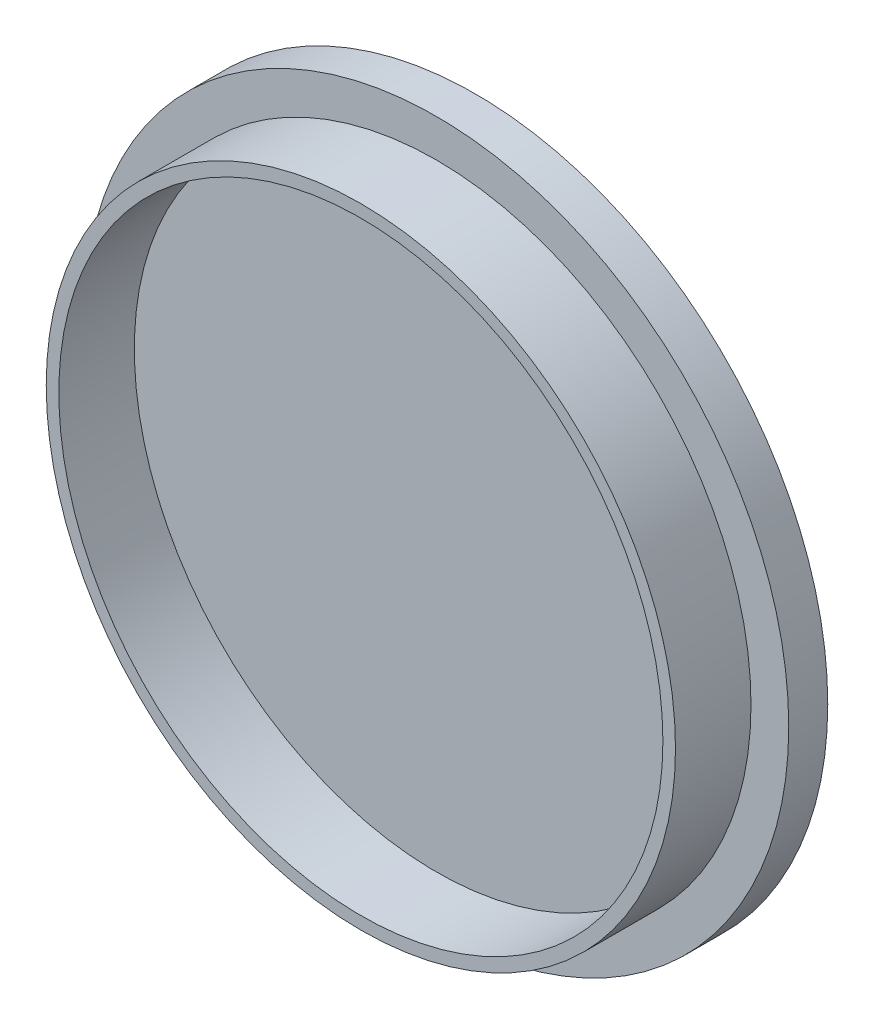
ISO-10303-21;
HEADER;
FILE_DESCRIPTION(('STEP AP214'),'2;1');
FILE_NAME('part.step','',(''),(''),'','','');
FILE_SCHEMA(('AUTOMOTIVE_DESIGN { 1 0 10303 214 1 1 1 1 }'));
ENDSEC;
DATA;
#1=APPLICATION_CONTEXT('core data for automotive mechanical design processes');
#2=APPLICATION_PROTOCOL_DEFINITION('international standard','automotive_design',2000,#1);
#3=PRODUCT_CONTEXT('',#1,'mechanical');
#4=PRODUCT('Part','Part','',(#3));
#5=PRODUCT_RELATED_PRODUCT_CATEGORY('part','',(#4));
#6=PRODUCT_DEFINITION_FORMATION('','',#4);
#7=PRODUCT_DEFINITION_CONTEXT('part definition',#1,'design');
#8=PRODUCT_DEFINITION('design','',#6,#7);
#9=PRODUCT_DEFINITION_SHAPE('','',#8);
#10=(LENGTH_UNIT() NAMED_UNIT(*) SI_UNIT(.MILLI.,.METRE.));
#11=(NAMED_UNIT(*) PLANE_ANGLE_UNIT() SI_UNIT($,.RADIAN.));
#12=(NAMED_UNIT(*) SI_UNIT($,.STERADIAN.) SOLID_ANGLE_UNIT());
#13=UNCERTAINTY_MEASURE_WITH_UNIT(LENGTH_MEASURE(1.E-05),#10,'distance_accuracy_value','');
#14=(GEOMETRIC_REPRESENTATION_CONTEXT(3) GLOBAL_UNCERTAINTY_ASSIGNED_CONTEXT((#13)) GLOBAL_UNIT_ASSIGNED_CONTEXT((#10,
#11,#12)) REPRESENTATION_CONTEXT('',''));
#15=CARTESIAN_POINT('',(0.,0.,0.));
#16=DIRECTION('',(0.,0.,1.));
#17=DIRECTION('',(1.,0.,0.));
#18=AXIS2_PLACEMENT_3D('',#15,#16,#17);
#19=CARTESIAN_POINT('',(0.,0.,3.09999999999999));
#20=DIRECTION('',(0.,0.,1.));
#21=DIRECTION('',(1.,0.,0.));
#22=AXIS2_PLACEMENT_3D('',#19,#20,#21);
#23=PLANE('',#22);
#24=CARTESIAN_POINT('',(0.,0.,3.09999999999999));
#25=DIRECTION('',(0.,0.,1.));
#26=DIRECTION('',(1.,0.,0.));
#27=AXIS2_PLACEMENT_3D('',#24,#25,#26);
#28=CIRCLE('',#27,28.);
#29=CARTESIAN_POINT('',(-28.,0.,3.09999999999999));
#30=VERTEX_POINT('',#29);
#31=EDGE_CURVE('E37',#30,#30,#28,.T.);
#32=ORIENTED_EDGE('',*,*,#31,.T.);
#33=EDGE_LOOP('',(#32));
#34=FACE_BOUND('',#33,.T.);
#35=CARTESIAN_POINT('',(0.,0.,3.09999999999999));
#36=DIRECTION('',(0.,0.,1.));
#37=DIRECTION('',(1.,0.,0.));
#38=AXIS2_PLACEMENT_3D('',#35,#36,#37);
#39=CIRCLE('',#38,25.);
#40=CARTESIAN_POINT('',(25.,0.,3.09999999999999));
#41=VERTEX_POINT('',#40);
#42=EDGE_CURVE('E50',#41,#41,#39,.T.);
#43=ORIENTED_EDGE('',*,*,#42,.F.);
#44=EDGE_LOOP('',(#43));
#45=FACE_BOUND('',#44,.T.);
#46=ADVANCED_FACE('F30',(#34,#45),#23,.T.);
#47=CARTESIAN_POINT('',(0.,0.,3.09999999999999));
#48=DIRECTION('',(0.,0.,-1.));
#49=DIRECTION('',(-1.,0.,0.));
#50=AXIS2_PLACEMENT_3D('',#47,#48,#49);
#51=CYLINDRICAL_SURFACE('',#50,28.);
#52=CARTESIAN_POINT('',(0.,0.,0.));
#53=DIRECTION('',(0.,0.,1.));
#54=DIRECTION('',(1.,0.,0.));
#55=AXIS2_PLACEMENT_3D('',#52,#53,#54);
#56=CIRCLE('',#55,28.);
#57=CARTESIAN_POINT('',(-28.,0.,0.));
#58=VERTEX_POINT('',#57);
#59=EDGE_CURVE('E41',#58,#58,#56,.T.);
#60=CARTESIAN_POINT('',(-28.,0.,3.09999999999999));
#61=CARTESIAN_POINT('',(-28.,0.,3.06770833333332));
#62=CARTESIAN_POINT('',(-28.,0.,3.03541666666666));
#63=CARTESIAN_POINT('',(-28.,0.,2.97083333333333));
#64=CARTESIAN_POINT('',(-28.,0.,2.93854166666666));
#65=CARTESIAN_POINT('',(-28.,0.,2.87395833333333));
#66=CARTESIAN_POINT('',(-28.,0.,2.84166666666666));
#67=CARTESIAN_POINT('',(-28.,0.,2.77708333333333));
#68=CARTESIAN_POINT('',(-28.,0.,2.74479166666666));
#69=CARTESIAN_POINT('',(-28.,0.,2.68020833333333));
#70=CARTESIAN_POINT('',(-28.,0.,2.64791666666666));
#71=CARTESIAN_POINT('',(-28.,0.,2.58333333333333));
#72=CARTESIAN_POINT('',(-28.,0.,2.55104166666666));
#73=CARTESIAN_POINT('',(-28.,0.,2.48645833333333));
#74=CARTESIAN_POINT('',(-28.,0.,2.45416666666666));
#75=CARTESIAN_POINT('',(-28.,0.,2.38958333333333));
#76=CARTESIAN_POINT('',(-28.,0.,2.35729166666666));
#77=CARTESIAN_POINT('',(-28.,0.,2.29270833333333));
#78=CARTESIAN_POINT('',(-28.,0.,2.26041666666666));
#79=CARTESIAN_POINT('',(-28.,0.,2.19583333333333));
#80=CARTESIAN_POINT('',(-28.,0.,2.16354166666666));
#81=CARTESIAN_POINT('',(-28.,0.,2.09895833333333));
#82=CARTESIAN_POINT('',(-28.,0.,2.06666666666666));
#83=CARTESIAN_POINT('',(-28.,0.,2.00208333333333));
#84=CARTESIAN_POINT('',(-28.,0.,1.96979166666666));
#85=CARTESIAN_POINT('',(-28.,0.,1.90520833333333));
#86=CARTESIAN_POINT('',(-28.,0.,1.87291666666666));
#87=CARTESIAN_POINT('',(-28.,0.,1.80833333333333));
#88=CARTESIAN_POINT('',(-28.,0.,1.77604166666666));
#89=CARTESIAN_POINT('',(-28.,0.,1.71145833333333));
#90=CARTESIAN_POINT('',(-28.,0.,1.67916666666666));
#91=CARTESIAN_POINT('',(-28.,0.,1.61458333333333));
#92=CARTESIAN_POINT('',(-28.,0.,1.58229166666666));
#93=CARTESIAN_POINT('',(-28.,0.,1.51770833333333));
#94=CARTESIAN_POINT('',(-28.,0.,1.48541666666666));
#95=CARTESIAN_POINT('',(-28.,0.,1.42083333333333));
#96=CARTESIAN_POINT('',(-28.,0.,1.38854166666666));
#97=CARTESIAN_POINT('',(-28.,0.,1.32395833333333));
#98=CARTESIAN_POINT('',(-28.,0.,1.29166666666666));
#99=CARTESIAN_POINT('',(-28.,0.,1.22708333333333));
#100=CARTESIAN_POINT('',(-28.,0.,1.19479166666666));
#101=CARTESIAN_POINT('',(-28.,0.,1.13020833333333));
#102=CARTESIAN_POINT('',(-28.,0.,1.09791666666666));
#103=CARTESIAN_POINT('',(-28.,0.,1.03333333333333));
#104=CARTESIAN_POINT('',(-28.,0.,1.00104166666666));
#105=CARTESIAN_POINT('',(-28.,0.,0.93645833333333));
#106=CARTESIAN_POINT('',(-28.,0.,0.904166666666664));
#107=CARTESIAN_POINT('',(-28.,0.,0.839583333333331));
#108=CARTESIAN_POINT('',(-28.,0.,0.807291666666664));
#109=CARTESIAN_POINT('',(-28.,0.,0.742708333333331));
#110=CARTESIAN_POINT('',(-28.,0.,0.710416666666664));
#111=CARTESIAN_POINT('',(-28.,0.,0.645833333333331));
#112=CARTESIAN_POINT('',(-28.,0.,0.613541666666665));
#113=CARTESIAN_POINT('',(-28.,0.,0.548958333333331));
#114=CARTESIAN_POINT('',(-28.,0.,0.516666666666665));
#115=CARTESIAN_POINT('',(-28.,0.,0.452083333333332));
#116=CARTESIAN_POINT('',(-28.,0.,0.419791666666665));
#117=CARTESIAN_POINT('',(-28.,0.,0.355208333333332));
#118=CARTESIAN_POINT('',(-28.,0.,0.322916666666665));
#119=CARTESIAN_POINT('',(-28.,0.,0.258333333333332));
#120=CARTESIAN_POINT('',(-28.,0.,0.226041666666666));
#121=CARTESIAN_POINT('',(-28.,0.,0.161458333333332));
#122=CARTESIAN_POINT('',(-28.,0.,0.129166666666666));
#123=CARTESIAN_POINT('',(-28.,0.,0.0645833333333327));
#124=CARTESIAN_POINT('',(-28.,0.,0.0322916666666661));
#125=CARTESIAN_POINT('',(-28.,0.,0.));
#126=B_SPLINE_CURVE_WITH_KNOTS('',3,(#60,#61,#62,#63,#64,#65,#66,#67,#68,#69,#70,#71,#72,#73,
#74,#75,#76,#77,#78,#79,#80,#81,#82,#83,#84,#85,#86,#87,#88,#89,#90,#91,#92,#93,#94,#95,#96,#97,
#98,#99,#100,#101,#102,#103,#104,#105,#106,#107,#108,#109,#110,#111,#112,#113,#114,#115,#116,
#117,#118,#119,#120,#121,#122,#123,#124,#125),.UNSPECIFIED.,.F.,.F.,(4,2,2,2,2,2,2,2,2,2,2,2,2,
2,2,2,2,2,2,2,2,2,2,2,2,2,2,2,2,2,2,2,4),(0.,0.0968749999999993,0.193749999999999,
0.290624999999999,0.387499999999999,0.484374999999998,0.581249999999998,0.678124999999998,
0.774999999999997,0.871874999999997,0.968749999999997,1.065625,1.1625,1.259375,1.35625,1.453125,
1.55,1.646875,1.74375,1.84062499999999,1.93749999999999,2.03437499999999,2.13124999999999,
2.22812499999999,2.32499999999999,2.42187499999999,2.51874999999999,2.61562499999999,
2.71249999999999,2.80937499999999,2.90624999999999,3.00312499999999,3.09999999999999),.UNSPECIFIED.);
#127=EDGE_CURVE('BSEAM32',#30,#58,#126,.T.);
#128=ORIENTED_EDGE('',*,*,#31,.F.);
#129=ORIENTED_EDGE('',*,*,#59,.T.);
#130=ORIENTED_EDGE('',*,*,#127,.T.);
#131=ORIENTED_EDGE('',*,*,#127,.F.);
#132=EDGE_LOOP('',(#128,#130,#129,#131));
#133=FACE_BOUND('',#132,.T.);
#134=ADVANCED_FACE('F32',(#133),#51,.T.);
#135=CARTESIAN_POINT('',(0.,0.,0.));
#136=DIRECTION('',(0.,0.,1.));
#137=DIRECTION('',(1.,0.,0.));
#138=AXIS2_PLACEMENT_3D('',#135,#136,#137);
#139=PLANE('',#138);
#140=ORIENTED_EDGE('',*,*,#59,.F.);
#141=EDGE_LOOP('',(#140));
#142=FACE_BOUND('',#141,.T.);
#143=ADVANCED_FACE('F62',(#142),#139,.F.);
#144=CARTESIAN_POINT('',(0.,0.,9.1));
#145=DIRECTION('',(0.,0.,1.));
#146=DIRECTION('',(1.,0.,0.));
#147=AXIS2_PLACEMENT_3D('',#144,#145,#146);
#148=PLANE('',#147);
#149=CARTESIAN_POINT('',(0.,0.,9.1));
#150=DIRECTION('',(0.,0.,1.));
#151=DIRECTION('',(1.,0.,0.));
#152=AXIS2_PLACEMENT_3D('',#149,#150,#151);
#153=CIRCLE('',#152,25.);
#154=CARTESIAN_POINT('',(25.0000000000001,0.,9.1));
#155=VERTEX_POINT('',#154);
#156=EDGE_CURVE('E45',#155,#155,#153,.T.);
#157=ORIENTED_EDGE('',*,*,#156,.T.);
#158=EDGE_LOOP('',(#157));
#159=FACE_BOUND('',#158,.T.);
#160=CARTESIAN_POINT('',(0.,0.,9.1));
#161=DIRECTION('',(0.,0.,1.));
#162=DIRECTION('',(1.,0.,0.));
#163=AXIS2_PLACEMENT_3D('',#160,#161,#162);
#164=CIRCLE('',#163,24.);
#165=CARTESIAN_POINT('',(24.0000000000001,0.,9.1));
#166=VERTEX_POINT('',#165);
#167=EDGE_CURVE('E53',#166,#166,#164,.T.);
#168=ORIENTED_EDGE('',*,*,#167,.F.);
#169=EDGE_LOOP('',(#168));
#170=FACE_BOUND('',#169,.T.);
#171=ADVANCED_FACE('F59',(#159,#170),#148,.T.);
#172=CARTESIAN_POINT('',(0.,0.,9.1));
#173=DIRECTION('',(0.,0.,-1.));
#174=DIRECTION('',(-1.,0.,0.));
#175=AXIS2_PLACEMENT_3D('',#172,#173,#174);
#176=CYLINDRICAL_SURFACE('',#175,25.);
#177=ORIENTED_EDGE('',*,*,#156,.F.);
#178=EDGE_LOOP('',(#177));
#179=FACE_BOUND('',#178,.T.);
#180=ORIENTED_EDGE('',*,*,#42,.T.);
#181=EDGE_LOOP('',(#180));
#182=FACE_BOUND('',#181,.T.);
#183=ADVANCED_FACE('F61',(#179,#182),#176,.T.);
#184=CARTESIAN_POINT('',(0.,0.,9.1));
#185=DIRECTION('',(0.,0.,-1.));
#186=DIRECTION('',(-1.,0.,0.));
#187=AXIS2_PLACEMENT_3D('',#184,#185,#186);
#188=CYLINDRICAL_SURFACE('',#187,24.);
#189=ORIENTED_EDGE('',*,*,#167,.T.);
#190=EDGE_LOOP('',(#189));
#191=FACE_BOUND('',#190,.T.);
#192=CARTESIAN_POINT('',(0.,0.,3.09999999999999));
#193=DIRECTION('',(0.,0.,1.));
#194=DIRECTION('',(1.,0.,0.));
#195=AXIS2_PLACEMENT_3D('',#192,#193,#194);
#196=CIRCLE('',#195,24.);
#197=CARTESIAN_POINT('',(24.,0.,3.09999999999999));
#198=VERTEX_POINT('',#197);
#199=EDGE_CURVE('E10',#198,#198,#196,.F.);
#200=ORIENTED_EDGE('',*,*,#199,.T.);
#201=EDGE_LOOP('',(#200));
#202=FACE_BOUND('',#201,.T.);
#203=ADVANCED_FACE('F57',(#191,#202),#188,.F.);
#204=ORIENTED_EDGE('',*,*,#199,.F.);
#205=EDGE_LOOP('',(#204));
#206=FACE_BOUND('',#205,.T.);
#207=ADVANCED_FACE('F75',(#206),#23,.T.);
#208=CLOSED_SHELL('',(#46,#134,#143,#171,#183,#203,#207));
#209=MANIFOLD_SOLID_BREP('B2',#208);
#210=ADVANCED_BREP_SHAPE_REPRESENTATION('',(#18,#209),#14);
#211=SHAPE_DEFINITION_REPRESENTATION(#9,#210);
ENDSEC;
END-ISO-10303-21;
